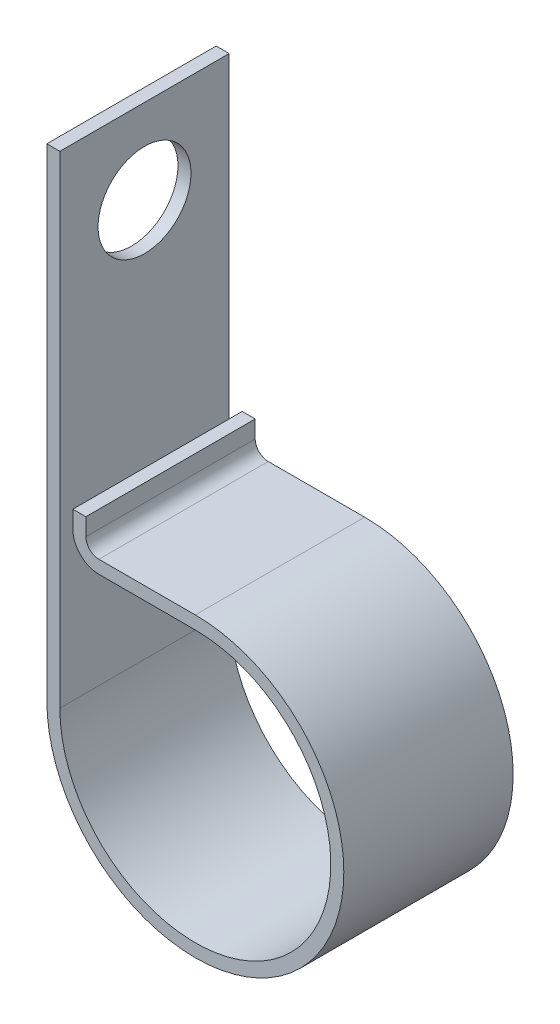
from build123d import *

# Parameters (mm, degrees)
EXTRUDE_THIN5_DEPTH              = 7.9375
F_13_32_0_40625_DIAMETER_HOLE1_D = 8.7122


with BuildPart() as part:
    # Sketch1 → Extrude-Thin5 (new, symmetric)
    with BuildSketch(Plane.XY):
        with BuildLine():
            Line((1.2192, -20.5232), (1.2192, -22.1488))
            ThreePointArc((1.2192, -22.1488), (1.933390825, -23.873009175), (3.6576, -24.5872))
            Line((3.6576, -24.5872), (12.7, -24.5872))
            ThreePointArc((12.7, -24.5872), (21.680256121, -46.267456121), (0, -37.2872))
            Line((0, -37.2872), (0, 7.9248))
            Line((0, 7.9248), (-1.2192, 7.9248))
            Line((-1.2192, 7.9248), (-1.2192, -37.2872))
            ThreePointArc((-1.2192, -37.2872), (22.542360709, -47.129560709), (12.7, -23.368))
            Line((12.7, -23.368), (3.6576, -23.368))
            ThreePointArc((3.6576, -23.368), (2.795495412, -23.010904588), (2.4384, -22.1488))
            Line((2.4384, -22.1488), (2.4384, -20.5232))
            Line((2.4384, -20.5232), (1.2192, -20.5232))
        make_face()
    extrude(amount=EXTRUDE_THIN5_DEPTH, both=True)

    # 13_32 _0.40625_ Diameter Hole1 (through all)
    with Locations(Plane(origin=(0, 0, 0), x_dir=(0, 0, -1), z_dir=(1, 0, 0))):
        with Locations((0, 0)):
            Hole(F_13_32_0_40625_DIAMETER_HOLE1_D / 2)


solid = part.part
